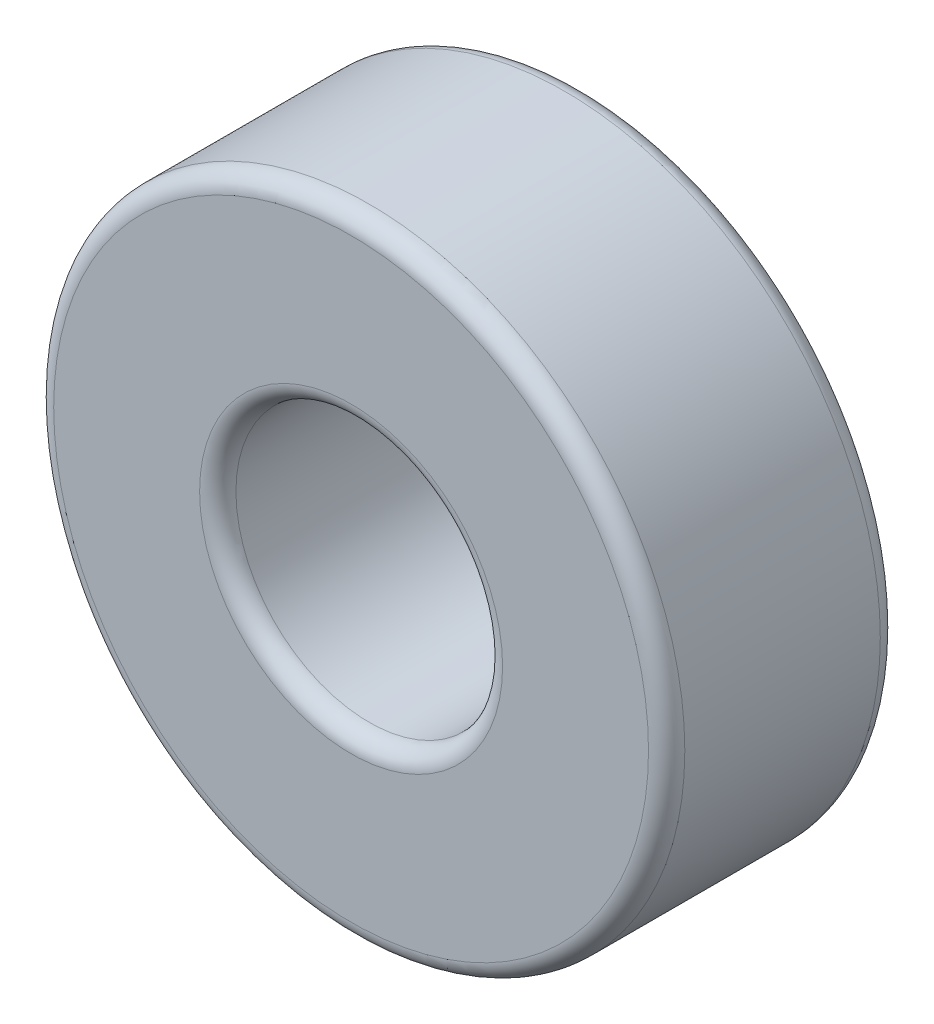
from build123d import *

# Parameters (mm, degrees)
SKETCH1_R          = 22.6
SKETCH1_R_2        = 9.55
MAIN_EXTRUDE_DEPTH = 8.3
FILLETS_R          = 1.3


with BuildPart() as part:
    # Sketch1 → Main Extrude (new, symmetric)
    with BuildSketch(Plane.XY):
        with Locations(Location((0, 0, 0), (0, 0, 180))):
            Circle(SKETCH1_R)
        with Locations(Location((0, 0, 0), (0, 0, 180))):
            Circle(SKETCH1_R_2, mode=Mode.SUBTRACT)
    extrude(amount=MAIN_EXTRUDE_DEPTH, both=True)

    # Fillets
    fillets_edges = [part.edges().sort_by_distance(p)[0] for p in [
        (22.6, 0, 8.3),
        (22.6, 0, -8.3),
        (9.55, 0, -8.3),
        (9.55, 0, 8.3),
    ]]
    fillet(fillets_edges, radius=FILLETS_R)


solid = part.part
